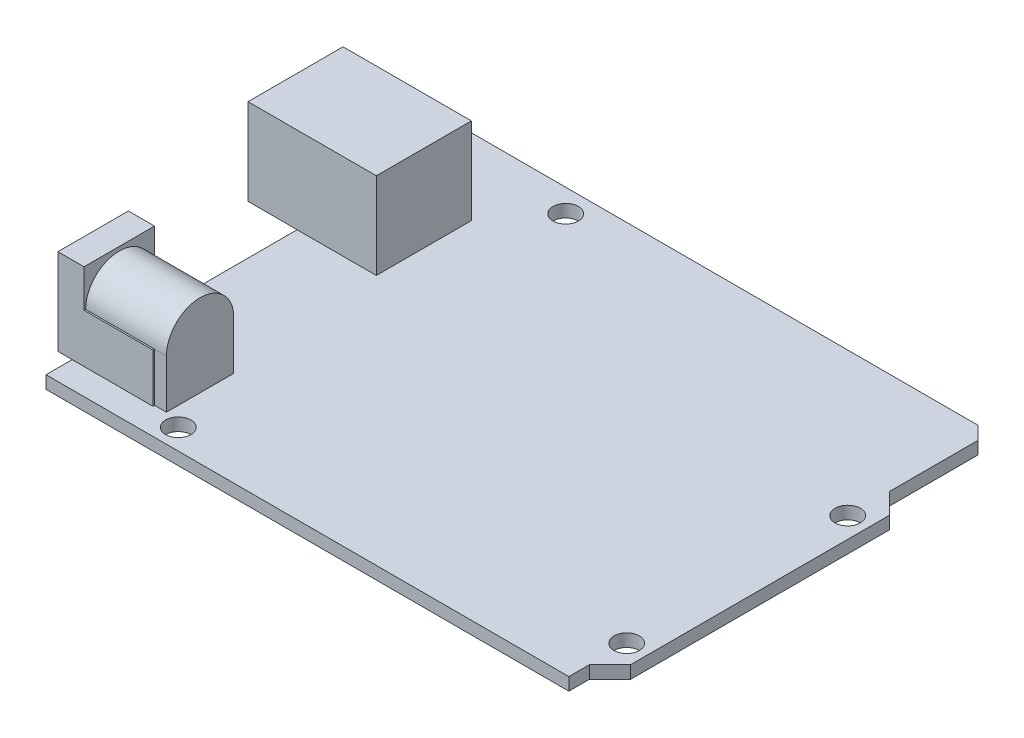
ISO-10303-21;
HEADER;
FILE_DESCRIPTION(('STEP AP214'),'2;1');
FILE_NAME('part.step','',(''),(''),'','','');
FILE_SCHEMA(('AUTOMOTIVE_DESIGN { 1 0 10303 214 1 1 1 1 }'));
ENDSEC;
DATA;
#1=APPLICATION_CONTEXT('core data for automotive mechanical design processes');
#2=APPLICATION_PROTOCOL_DEFINITION('international standard','automotive_design',2000,#1);
#3=PRODUCT_CONTEXT('',#1,'mechanical');
#4=PRODUCT('Part','Part','',(#3));
#5=PRODUCT_RELATED_PRODUCT_CATEGORY('part','',(#4));
#6=PRODUCT_DEFINITION_FORMATION('','',#4);
#7=PRODUCT_DEFINITION_CONTEXT('part definition',#1,'design');
#8=PRODUCT_DEFINITION('design','',#6,#7);
#9=PRODUCT_DEFINITION_SHAPE('','',#8);
#10=(LENGTH_UNIT() NAMED_UNIT(*) SI_UNIT(.MILLI.,.METRE.));
#11=(NAMED_UNIT(*) PLANE_ANGLE_UNIT() SI_UNIT($,.RADIAN.));
#12=(NAMED_UNIT(*) SI_UNIT($,.STERADIAN.) SOLID_ANGLE_UNIT());
#13=UNCERTAINTY_MEASURE_WITH_UNIT(LENGTH_MEASURE(1.E-05),#10,'distance_accuracy_value','');
#14=(GEOMETRIC_REPRESENTATION_CONTEXT(3) GLOBAL_UNCERTAINTY_ASSIGNED_CONTEXT((#13)) GLOBAL_UNIT_ASSIGNED_CONTEXT((#10,
#11,#12)) REPRESENTATION_CONTEXT('',''));
#15=CARTESIAN_POINT('',(0.,0.,0.));
#16=DIRECTION('',(0.,0.,1.));
#17=DIRECTION('',(1.,0.,0.));
#18=AXIS2_PLACEMENT_3D('',#15,#16,#17);
#19=CARTESIAN_POINT('',(0.,12.5,0.));
#20=DIRECTION('',(0.,1.,0.));
#21=DIRECTION('',(0.,0.,1.));
#22=AXIS2_PLACEMENT_3D('',#19,#20,#21);
#23=PLANE('',#22);
#24=DIRECTION('',(1.,0.,0.));
#25=VECTOR('',#24,1.);
#26=CARTESIAN_POINT('',(-36.1,12.5,23.35));
#27=LINE('',#26,#25);
#28=CARTESIAN_POINT('',(-36.1,12.5,23.35));
#29=VERTEX_POINT('',#28);
#30=CARTESIAN_POINT('',(-32.8,12.5,23.35));
#31=VERTEX_POINT('',#30);
#32=EDGE_CURVE('E281',#29,#31,#27,.T.);
#33=ORIENTED_EDGE('',*,*,#32,.T.);
#34=DIRECTION('',(0.,0.,-1.));
#35=VECTOR('',#34,1.);
#36=CARTESIAN_POINT('',(-32.8,12.5,0.));
#37=LINE('',#36,#35);
#38=CARTESIAN_POINT('',(-32.8,12.5,14.45));
#39=VERTEX_POINT('',#38);
#40=EDGE_CURVE('E11',#31,#39,#37,.T.);
#41=ORIENTED_EDGE('',*,*,#40,.T.);
#42=DIRECTION('',(-1.,0.,0.));
#43=VECTOR('',#42,1.);
#44=CARTESIAN_POINT('',(-36.1,12.5,14.45));
#45=LINE('',#44,#43);
#46=CARTESIAN_POINT('',(-36.1,12.5,14.45));
#47=VERTEX_POINT('',#46);
#48=EDGE_CURVE('E284',#39,#47,#45,.T.);
#49=ORIENTED_EDGE('',*,*,#48,.T.);
#50=DIRECTION('',(0.,0.,1.));
#51=VECTOR('',#50,1.);
#52=CARTESIAN_POINT('',(-36.1,12.5,14.45));
#53=LINE('',#52,#51);
#54=EDGE_CURVE('E278',#47,#29,#53,.T.);
#55=ORIENTED_EDGE('',*,*,#54,.T.);
#56=EDGE_LOOP('',(#33,#41,#49,#55));
#57=FACE_BOUND('',#56,.T.);
#58=ADVANCED_FACE('F32',(#57),#23,.T.);
#59=CARTESIAN_POINT('',(-22.6,12.5,14.45));
#60=DIRECTION('',(-1.,0.,0.));
#61=DIRECTION('',(0.,0.,1.));
#62=AXIS2_PLACEMENT_3D('',#59,#60,#61);
#63=PLANE('',#62);
#64=DIRECTION('',(0.,-1.,0.));
#65=VECTOR('',#64,1.);
#66=CARTESIAN_POINT('',(-22.6,0.,14.65));
#67=LINE('',#66,#65);
#68=CARTESIAN_POINT('',(-22.6,7.75,14.65));
#69=VERTEX_POINT('',#68);
#70=CARTESIAN_POINT('',(-22.6,1.6,14.65));
#71=VERTEX_POINT('',#70);
#72=EDGE_CURVE('E247',#69,#71,#67,.T.);
#73=ORIENTED_EDGE('',*,*,#72,.F.);
#74=CARTESIAN_POINT('',(-22.6,7.75,18.9));
#75=DIRECTION('',(-1.,0.,0.));
#76=DIRECTION('',(0.,0.,-1.));
#77=AXIS2_PLACEMENT_3D('',#74,#75,#76);
#78=CIRCLE('',#77,4.25);
#79=CARTESIAN_POINT('',(-22.6,7.75,23.15));
#80=VERTEX_POINT('',#79);
#81=EDGE_CURVE('E217',#80,#69,#78,.T.);
#82=ORIENTED_EDGE('',*,*,#81,.F.);
#83=DIRECTION('',(0.,-1.,0.));
#84=VECTOR('',#83,1.);
#85=CARTESIAN_POINT('',(-22.6,0.,23.15));
#86=LINE('',#85,#84);
#87=CARTESIAN_POINT('',(-22.6,1.6,23.15));
#88=VERTEX_POINT('',#87);
#89=EDGE_CURVE('E260',#80,#88,#86,.T.);
#90=ORIENTED_EDGE('',*,*,#89,.T.);
#91=DIRECTION('',(0.,0.,-1.));
#92=VECTOR('',#91,1.);
#93=CARTESIAN_POINT('',(-22.6,1.6,14.45));
#94=LINE('',#93,#92);
#95=EDGE_CURVE('E293',#88,#71,#94,.T.);
#96=ORIENTED_EDGE('',*,*,#95,.T.);
#97=EDGE_LOOP('',(#73,#82,#90,#96));
#98=FACE_BOUND('',#97,.T.);
#99=ADVANCED_FACE('F519',(#98),#63,.F.);
#100=CARTESIAN_POINT('',(-36.1,12.5,14.45));
#101=DIRECTION('',(0.,0.,1.));
#102=DIRECTION('',(1.,0.,0.));
#103=AXIS2_PLACEMENT_3D('',#100,#101,#102);
#104=PLANE('',#103);
#105=DIRECTION('',(0.,1.,0.));
#106=VECTOR('',#105,1.);
#107=CARTESIAN_POINT('',(-32.8,12.5,14.45));
#108=LINE('',#107,#106);
#109=CARTESIAN_POINT('',(-32.8,7.75,14.45));
#110=VERTEX_POINT('',#109);
#111=EDGE_CURVE('E245',#110,#39,#108,.T.);
#112=ORIENTED_EDGE('',*,*,#111,.F.);
#113=DIRECTION('',(1.,0.,0.));
#114=VECTOR('',#113,1.);
#115=CARTESIAN_POINT('',(-36.1,7.75,14.45));
#116=LINE('',#115,#114);
#117=CARTESIAN_POINT('',(-24.1,7.75,14.45));
#118=VERTEX_POINT('',#117);
#119=EDGE_CURVE('E238',#110,#118,#116,.T.);
#120=ORIENTED_EDGE('',*,*,#119,.T.);
#121=DIRECTION('',(0.,1.,0.));
#122=VECTOR('',#121,1.);
#123=CARTESIAN_POINT('',(-24.1,0.,14.45));
#124=LINE('',#123,#122);
#125=CARTESIAN_POINT('',(-24.1,1.6,14.45));
#126=VERTEX_POINT('',#125);
#127=EDGE_CURVE('E253',#126,#118,#124,.T.);
#128=ORIENTED_EDGE('',*,*,#127,.F.);
#129=DIRECTION('',(-1.,0.,0.));
#130=VECTOR('',#129,1.);
#131=CARTESIAN_POINT('',(-36.1,1.6,14.45));
#132=LINE('',#131,#130);
#133=CARTESIAN_POINT('',(-34.3,1.6,14.45));
#134=VERTEX_POINT('',#133);
#135=EDGE_CURVE('E54',#126,#134,#132,.T.);
#136=ORIENTED_EDGE('',*,*,#135,.T.);
#137=CARTESIAN_POINT('',(-36.1,1.6,14.45));
#138=VERTEX_POINT('',#137);
#139=EDGE_CURVE('E296',#134,#138,#132,.T.);
#140=ORIENTED_EDGE('',*,*,#139,.T.);
#141=DIRECTION('',(0.,-1.,0.));
#142=VECTOR('',#141,1.);
#143=CARTESIAN_POINT('',(-36.1,12.5,14.45));
#144=LINE('',#143,#142);
#145=EDGE_CURVE('E286',#47,#138,#144,.T.);
#146=ORIENTED_EDGE('',*,*,#145,.F.);
#147=ORIENTED_EDGE('',*,*,#48,.F.);
#148=EDGE_LOOP('',(#112,#120,#128,#136,#140,#146,#147));
#149=FACE_BOUND('',#148,.T.);
#150=ADVANCED_FACE('F525',(#149),#104,.F.);
#151=CARTESIAN_POINT('',(0.,1.6,0.));
#152=DIRECTION('',(0.,1.,0.));
#153=DIRECTION('',(0.,0.,1.));
#154=AXIS2_PLACEMENT_3D('',#151,#152,#153);
#155=PLANE('',#154);
#156=CARTESIAN_POINT('',(31.7,1.6,-8.54999999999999));
#157=DIRECTION('',(0.,1.,0.));
#158=DIRECTION('',(0.,0.,1.));
#159=AXIS2_PLACEMENT_3D('',#156,#157,#158);
#160=CIRCLE('',#159,1.6);
#161=CARTESIAN_POINT('',(31.7,1.6,-6.94999999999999));
#162=VERTEX_POINT('',#161);
#163=EDGE_CURVE('E344',#162,#162,#160,.T.);
#164=ORIENTED_EDGE('',*,*,#163,.F.);
#165=EDGE_LOOP('',(#164));
#166=FACE_BOUND('',#165,.T.);
#167=CARTESIAN_POINT('',(-19.1,1.6,-23.75));
#168=DIRECTION('',(0.,1.,0.));
#169=DIRECTION('',(0.,0.,1.));
#170=AXIS2_PLACEMENT_3D('',#167,#168,#169);
#171=CIRCLE('',#170,1.6);
#172=CARTESIAN_POINT('',(-19.1,1.6,-22.15));
#173=VERTEX_POINT('',#172);
#174=EDGE_CURVE('E356',#173,#173,#171,.T.);
#175=ORIENTED_EDGE('',*,*,#174,.F.);
#176=EDGE_LOOP('',(#175));
#177=FACE_BOUND('',#176,.T.);
#178=CARTESIAN_POINT('',(-20.2,1.6,24.05));
#179=DIRECTION('',(0.,1.,0.));
#180=DIRECTION('',(0.,0.,1.));
#181=AXIS2_PLACEMENT_3D('',#178,#179,#180);
#182=CIRCLE('',#181,1.6);
#183=CARTESIAN_POINT('',(-20.2,1.6,25.65));
#184=VERTEX_POINT('',#183);
#185=EDGE_CURVE('E350',#184,#184,#182,.T.);
#186=ORIENTED_EDGE('',*,*,#185,.F.);
#187=EDGE_LOOP('',(#186));
#188=FACE_BOUND('',#187,.T.);
#189=CARTESIAN_POINT('',(31.7,1.6,19.35));
#190=DIRECTION('',(0.,1.,0.));
#191=DIRECTION('',(0.,0.,1.));
#192=AXIS2_PLACEMENT_3D('',#189,#190,#191);
#193=CIRCLE('',#192,1.6);
#194=CARTESIAN_POINT('',(31.7,1.6,20.95));
#195=VERTEX_POINT('',#194);
#196=EDGE_CURVE('E338',#195,#195,#193,.T.);
#197=ORIENTED_EDGE('',*,*,#196,.F.);
#198=EDGE_LOOP('',(#197));
#199=FACE_BOUND('',#198,.T.);
#200=ORIENTED_EDGE('',*,*,#95,.F.);
#201=DIRECTION('',(1.,0.,0.));
#202=VECTOR('',#201,1.);
#203=CARTESIAN_POINT('',(-24.1,1.6,23.15));
#204=LINE('',#203,#202);
#205=CARTESIAN_POINT('',(-24.1,1.6,23.15));
#206=VERTEX_POINT('',#205);
#207=EDGE_CURVE('E274',#206,#88,#204,.T.);
#208=ORIENTED_EDGE('',*,*,#207,.F.);
#209=DIRECTION('',(0.,0.,-1.));
#210=VECTOR('',#209,1.);
#211=CARTESIAN_POINT('',(-24.1,1.6,0.));
#212=LINE('',#211,#210);
#213=CARTESIAN_POINT('',(-24.1,1.6,23.35));
#214=VERTEX_POINT('',#213);
#215=EDGE_CURVE('E268',#214,#206,#212,.T.);
#216=ORIENTED_EDGE('',*,*,#215,.F.);
#217=DIRECTION('',(1.,0.,0.));
#218=VECTOR('',#217,1.);
#219=CARTESIAN_POINT('',(-36.1,1.6,23.35));
#220=LINE('',#219,#218);
#221=CARTESIAN_POINT('',(-34.3,1.6,23.35));
#222=VERTEX_POINT('',#221);
#223=EDGE_CURVE('E289',#222,#214,#220,.T.);
#224=ORIENTED_EDGE('',*,*,#223,.F.);
#225=DIRECTION('',(0.,0.,1.));
#226=VECTOR('',#225,1.);
#227=CARTESIAN_POINT('',(-34.3,1.6,-26.65));
#228=LINE('',#227,#226);
#229=CARTESIAN_POINT('',(-34.3,1.6,26.65));
#230=VERTEX_POINT('',#229);
#231=EDGE_CURVE('E367',#222,#230,#228,.T.);
#232=ORIENTED_EDGE('',*,*,#231,.T.);
#233=DIRECTION('',(1.,0.,0.));
#234=VECTOR('',#233,1.);
#235=CARTESIAN_POINT('',(-34.3,1.6,26.65));
#236=LINE('',#235,#234);
#237=CARTESIAN_POINT('',(31.7,1.6,26.65));
#238=VERTEX_POINT('',#237);
#239=EDGE_CURVE('E365',#230,#238,#236,.T.);
#240=ORIENTED_EDGE('',*,*,#239,.T.);
#241=DIRECTION('',(0.,0.,-1.));
#242=VECTOR('',#241,1.);
#243=CARTESIAN_POINT('',(31.7,1.6,24.05));
#244=LINE('',#243,#242);
#245=CARTESIAN_POINT('',(31.7,1.6,24.05));
#246=VERTEX_POINT('',#245);
#247=EDGE_CURVE('E369',#238,#246,#244,.T.);
#248=ORIENTED_EDGE('',*,*,#247,.T.);
#249=DIRECTION('',(0.707106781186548,0.,-0.707106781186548));
#250=VECTOR('',#249,1.);
#251=CARTESIAN_POINT('',(34.3,1.6,21.45));
#252=LINE('',#251,#250);
#253=CARTESIAN_POINT('',(34.3,1.6,21.45));
#254=VERTEX_POINT('',#253);
#255=EDGE_CURVE('E371',#246,#254,#252,.T.);
#256=ORIENTED_EDGE('',*,*,#255,.T.);
#257=DIRECTION('',(0.,0.,-1.));
#258=VECTOR('',#257,1.);
#259=CARTESIAN_POINT('',(34.3,1.6,-11.25));
#260=LINE('',#259,#258);
#261=CARTESIAN_POINT('',(34.3,1.6,-11.25));
#262=VERTEX_POINT('',#261);
#263=EDGE_CURVE('E373',#254,#262,#260,.T.);
#264=ORIENTED_EDGE('',*,*,#263,.T.);
#265=DIRECTION('',(-0.707106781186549,0.,-0.707106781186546));
#266=VECTOR('',#265,1.);
#267=CARTESIAN_POINT('',(31.7,1.6,-13.85));
#268=LINE('',#267,#266);
#269=CARTESIAN_POINT('',(31.7,1.6,-13.85));
#270=VERTEX_POINT('',#269);
#271=EDGE_CURVE('E375',#262,#270,#268,.T.);
#272=ORIENTED_EDGE('',*,*,#271,.T.);
#273=DIRECTION('',(0.,0.,-1.));
#274=VECTOR('',#273,1.);
#275=CARTESIAN_POINT('',(31.7,1.6,-25.));
#276=LINE('',#275,#274);
#277=CARTESIAN_POINT('',(31.7,1.6,-25.));
#278=VERTEX_POINT('',#277);
#279=EDGE_CURVE('E377',#270,#278,#276,.T.);
#280=ORIENTED_EDGE('',*,*,#279,.T.);
#281=DIRECTION('',(-0.707106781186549,0.,-0.707106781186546));
#282=VECTOR('',#281,1.);
#283=CARTESIAN_POINT('',(30.05,1.6,-26.65));
#284=LINE('',#283,#282);
#285=CARTESIAN_POINT('',(30.05,1.6,-26.65));
#286=VERTEX_POINT('',#285);
#287=EDGE_CURVE('E379',#278,#286,#284,.T.);
#288=ORIENTED_EDGE('',*,*,#287,.T.);
#289=DIRECTION('',(-1.,0.,0.));
#290=VECTOR('',#289,1.);
#291=CARTESIAN_POINT('',(-34.3,1.6,-26.65));
#292=LINE('',#291,#290);
#293=CARTESIAN_POINT('',(-34.3,1.6,-26.65));
#294=VERTEX_POINT('',#293);
#295=EDGE_CURVE('E381',#286,#294,#292,.T.);
#296=ORIENTED_EDGE('',*,*,#295,.T.);
#297=CARTESIAN_POINT('',(-34.3,1.6,-17.05));
#298=VERTEX_POINT('',#297);
#299=EDGE_CURVE('E362',#294,#298,#228,.T.);
#300=ORIENTED_EDGE('',*,*,#299,.T.);
#301=DIRECTION('',(-1.,0.,0.));
#302=VECTOR('',#301,1.);
#303=CARTESIAN_POINT('',(-40.5,1.6,-17.05));
#304=LINE('',#303,#302);
#305=CARTESIAN_POINT('',(-24.3,1.6,-17.05));
#306=VERTEX_POINT('',#305);
#307=EDGE_CURVE('E308',#306,#298,#304,.T.);
#308=ORIENTED_EDGE('',*,*,#307,.F.);
#309=DIRECTION('',(0.,0.,-1.));
#310=VECTOR('',#309,1.);
#311=CARTESIAN_POINT('',(-24.3,1.6,-17.05));
#312=LINE('',#311,#310);
#313=CARTESIAN_POINT('',(-24.3,1.6,-5.05));
#314=VERTEX_POINT('',#313);
#315=EDGE_CURVE('E320',#314,#306,#312,.T.);
#316=ORIENTED_EDGE('',*,*,#315,.F.);
#317=DIRECTION('',(1.,0.,0.));
#318=VECTOR('',#317,1.);
#319=CARTESIAN_POINT('',(-40.5,1.6,-5.05));
#320=LINE('',#319,#318);
#321=CARTESIAN_POINT('',(-34.3,1.6,-5.05));
#322=VERTEX_POINT('',#321);
#323=EDGE_CURVE('E40',#322,#314,#320,.T.);
#324=ORIENTED_EDGE('',*,*,#323,.F.);
#325=EDGE_CURVE('E455',#322,#134,#228,.T.);
#326=ORIENTED_EDGE('',*,*,#325,.T.);
#327=ORIENTED_EDGE('',*,*,#135,.F.);
#328=DIRECTION('',(0.,0.,-1.));
#329=VECTOR('',#328,1.);
#330=CARTESIAN_POINT('',(-24.1,1.6,0.));
#331=LINE('',#330,#329);
#332=CARTESIAN_POINT('',(-24.1,1.6,14.65));
#333=VERTEX_POINT('',#332);
#334=EDGE_CURVE('E47',#333,#126,#331,.T.);
#335=ORIENTED_EDGE('',*,*,#334,.F.);
#336=DIRECTION('',(1.,0.,0.));
#337=VECTOR('',#336,1.);
#338=CARTESIAN_POINT('',(-24.1,1.6,14.65));
#339=LINE('',#338,#337);
#340=EDGE_CURVE('E258',#333,#71,#339,.T.);
#341=ORIENTED_EDGE('',*,*,#340,.T.);
#342=EDGE_LOOP('',(#200,#208,#216,#224,#232,#240,#248,#256,#264,#272,#280,#288,#296,#300,#308,
#316,#324,#326,#327,#335,#341));
#343=FACE_BOUND('',#342,.T.);
#344=ADVANCED_FACE('F462',(#166,#177,#188,#199,#343),#155,.T.);
#345=CARTESIAN_POINT('',(0.,0.,0.));
#346=DIRECTION('',(0.,1.,0.));
#347=DIRECTION('',(0.,0.,1.));
#348=AXIS2_PLACEMENT_3D('',#345,#346,#347);
#349=PLANE('',#348);
#350=DIRECTION('',(0.,0.,1.));
#351=VECTOR('',#350,1.);
#352=CARTESIAN_POINT('',(-34.3,0.,-26.65));
#353=LINE('',#352,#351);
#354=CARTESIAN_POINT('',(-34.3,0.,-26.65));
#355=VERTEX_POINT('',#354);
#356=CARTESIAN_POINT('',(-34.3,0.,26.65));
#357=VERTEX_POINT('',#356);
#358=EDGE_CURVE('E359',#355,#357,#353,.T.);
#359=ORIENTED_EDGE('',*,*,#358,.F.);
#360=DIRECTION('',(-1.,0.,0.));
#361=VECTOR('',#360,1.);
#362=CARTESIAN_POINT('',(-34.3,0.,-26.65));
#363=LINE('',#362,#361);
#364=CARTESIAN_POINT('',(30.05,0.,-26.65));
#365=VERTEX_POINT('',#364);
#366=EDGE_CURVE('E400',#365,#355,#363,.T.);
#367=ORIENTED_EDGE('',*,*,#366,.F.);
#368=DIRECTION('',(-0.707106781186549,0.,-0.707106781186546));
#369=VECTOR('',#368,1.);
#370=CARTESIAN_POINT('',(30.05,0.,-26.65));
#371=LINE('',#370,#369);
#372=CARTESIAN_POINT('',(31.7,0.,-25.));
#373=VERTEX_POINT('',#372);
#374=EDGE_CURVE('E398',#373,#365,#371,.T.);
#375=ORIENTED_EDGE('',*,*,#374,.F.);
#376=DIRECTION('',(0.,0.,-1.));
#377=VECTOR('',#376,1.);
#378=CARTESIAN_POINT('',(31.7,0.,-25.));
#379=LINE('',#378,#377);
#380=CARTESIAN_POINT('',(31.7,0.,-13.85));
#381=VERTEX_POINT('',#380);
#382=EDGE_CURVE('E396',#381,#373,#379,.T.);
#383=ORIENTED_EDGE('',*,*,#382,.F.);
#384=DIRECTION('',(-0.707106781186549,0.,-0.707106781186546));
#385=VECTOR('',#384,1.);
#386=CARTESIAN_POINT('',(31.7,0.,-13.85));
#387=LINE('',#386,#385);
#388=CARTESIAN_POINT('',(34.3,0.,-11.25));
#389=VERTEX_POINT('',#388);
#390=EDGE_CURVE('E394',#389,#381,#387,.T.);
#391=ORIENTED_EDGE('',*,*,#390,.F.);
#392=DIRECTION('',(0.,0.,-1.));
#393=VECTOR('',#392,1.);
#394=CARTESIAN_POINT('',(34.3,0.,-11.25));
#395=LINE('',#394,#393);
#396=CARTESIAN_POINT('',(34.3,0.,21.45));
#397=VERTEX_POINT('',#396);
#398=EDGE_CURVE('E392',#397,#389,#395,.T.);
#399=ORIENTED_EDGE('',*,*,#398,.F.);
#400=DIRECTION('',(0.707106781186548,0.,-0.707106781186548));
#401=VECTOR('',#400,1.);
#402=CARTESIAN_POINT('',(34.3,0.,21.45));
#403=LINE('',#402,#401);
#404=CARTESIAN_POINT('',(31.7,0.,24.05));
#405=VERTEX_POINT('',#404);
#406=EDGE_CURVE('E390',#405,#397,#403,.T.);
#407=ORIENTED_EDGE('',*,*,#406,.F.);
#408=DIRECTION('',(0.,0.,-1.));
#409=VECTOR('',#408,1.);
#410=CARTESIAN_POINT('',(31.7,0.,24.05));
#411=LINE('',#410,#409);
#412=CARTESIAN_POINT('',(31.7,0.,26.65));
#413=VERTEX_POINT('',#412);
#414=EDGE_CURVE('E388',#413,#405,#411,.T.);
#415=ORIENTED_EDGE('',*,*,#414,.F.);
#416=DIRECTION('',(1.,0.,0.));
#417=VECTOR('',#416,1.);
#418=CARTESIAN_POINT('',(-34.3,0.,26.65));
#419=LINE('',#418,#417);
#420=EDGE_CURVE('E386',#357,#413,#419,.T.);
#421=ORIENTED_EDGE('',*,*,#420,.F.);
#422=EDGE_LOOP('',(#359,#367,#375,#383,#391,#399,#407,#415,#421));
#423=FACE_BOUND('',#422,.T.);
#424=CARTESIAN_POINT('',(-19.1,0.,-23.75));
#425=DIRECTION('',(0.,1.,0.));
#426=DIRECTION('',(0.,0.,1.));
#427=AXIS2_PLACEMENT_3D('',#424,#425,#426);
#428=CIRCLE('',#427,1.6);
#429=CARTESIAN_POINT('',(-19.1,0.,-22.15));
#430=VERTEX_POINT('',#429);
#431=EDGE_CURVE('E353',#430,#430,#428,.T.);
#432=ORIENTED_EDGE('',*,*,#431,.T.);
#433=EDGE_LOOP('',(#432));
#434=FACE_BOUND('',#433,.T.);
#435=CARTESIAN_POINT('',(-20.2,0.,24.05));
#436=DIRECTION('',(0.,1.,0.));
#437=DIRECTION('',(0.,0.,1.));
#438=AXIS2_PLACEMENT_3D('',#435,#436,#437);
#439=CIRCLE('',#438,1.6);
#440=CARTESIAN_POINT('',(-20.2,0.,25.65));
#441=VERTEX_POINT('',#440);
#442=EDGE_CURVE('E347',#441,#441,#439,.T.);
#443=ORIENTED_EDGE('',*,*,#442,.T.);
#444=EDGE_LOOP('',(#443));
#445=FACE_BOUND('',#444,.T.);
#446=CARTESIAN_POINT('',(31.7,0.,-8.54999999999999));
#447=DIRECTION('',(0.,1.,0.));
#448=DIRECTION('',(0.,0.,1.));
#449=AXIS2_PLACEMENT_3D('',#446,#447,#448);
#450=CIRCLE('',#449,1.6);
#451=CARTESIAN_POINT('',(31.7,0.,-6.94999999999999));
#452=VERTEX_POINT('',#451);
#453=EDGE_CURVE('E341',#452,#452,#450,.T.);
#454=ORIENTED_EDGE('',*,*,#453,.T.);
#455=EDGE_LOOP('',(#454));
#456=FACE_BOUND('',#455,.T.);
#457=CARTESIAN_POINT('',(31.7,0.,19.35));
#458=DIRECTION('',(0.,1.,0.));
#459=DIRECTION('',(0.,0.,1.));
#460=AXIS2_PLACEMENT_3D('',#457,#458,#459);
#461=CIRCLE('',#460,1.6);
#462=CARTESIAN_POINT('',(31.7,0.,20.95));
#463=VERTEX_POINT('',#462);
#464=EDGE_CURVE('E337',#463,#463,#461,.T.);
#465=ORIENTED_EDGE('',*,*,#464,.T.);
#466=EDGE_LOOP('',(#465));
#467=FACE_BOUND('',#466,.T.);
#468=ADVANCED_FACE('F472',(#423,#434,#445,#456,#467),#349,.F.);
#469=CARTESIAN_POINT('',(-34.3,1.6,-26.65));
#470=DIRECTION('',(1.,0.,0.));
#471=DIRECTION('',(0.,0.,-1.));
#472=AXIS2_PLACEMENT_3D('',#469,#470,#471);
#473=PLANE('',#472);
#474=ORIENTED_EDGE('',*,*,#358,.T.);
#475=DIRECTION('',(0.,-1.,0.));
#476=VECTOR('',#475,1.);
#477=CARTESIAN_POINT('',(-34.3,1.6,26.65));
#478=LINE('',#477,#476);
#479=EDGE_CURVE('E424',#230,#357,#478,.T.);
#480=ORIENTED_EDGE('',*,*,#479,.F.);
#481=ORIENTED_EDGE('',*,*,#231,.F.);
#482=EDGE_CURVE('E456',#134,#222,#228,.T.);
#483=ORIENTED_EDGE('',*,*,#482,.F.);
#484=ORIENTED_EDGE('',*,*,#325,.F.);
#485=EDGE_CURVE('E366',#298,#322,#228,.T.);
#486=ORIENTED_EDGE('',*,*,#485,.F.);
#487=ORIENTED_EDGE('',*,*,#299,.F.);
#488=DIRECTION('',(0.,-1.,0.));
#489=VECTOR('',#488,1.);
#490=CARTESIAN_POINT('',(-34.3,1.6,-26.65));
#491=LINE('',#490,#489);
#492=EDGE_CURVE('E383',#294,#355,#491,.T.);
#493=ORIENTED_EDGE('',*,*,#492,.T.);
#494=EDGE_LOOP('',(#474,#480,#481,#483,#484,#486,#487,#493));
#495=FACE_BOUND('',#494,.T.);
#496=ADVANCED_FACE('F34',(#495),#473,.F.);
#497=CARTESIAN_POINT('',(-34.3,1.6,26.65));
#498=DIRECTION('',(0.,0.,-1.));
#499=DIRECTION('',(-1.,0.,0.));
#500=AXIS2_PLACEMENT_3D('',#497,#498,#499);
#501=PLANE('',#500);
#502=ORIENTED_EDGE('',*,*,#420,.T.);
#503=DIRECTION('',(0.,-1.,0.));
#504=VECTOR('',#503,1.);
#505=CARTESIAN_POINT('',(31.7,1.6,26.65));
#506=LINE('',#505,#504);
#507=EDGE_CURVE('E422',#238,#413,#506,.T.);
#508=ORIENTED_EDGE('',*,*,#507,.F.);
#509=ORIENTED_EDGE('',*,*,#239,.F.);
#510=ORIENTED_EDGE('',*,*,#479,.T.);
#511=EDGE_LOOP('',(#502,#508,#509,#510));
#512=FACE_BOUND('',#511,.T.);
#513=ADVANCED_FACE('F466',(#512),#501,.F.);
#514=CARTESIAN_POINT('',(31.7,1.6,24.05));
#515=DIRECTION('',(-1.,0.,0.));
#516=DIRECTION('',(0.,0.,1.));
#517=AXIS2_PLACEMENT_3D('',#514,#515,#516);
#518=PLANE('',#517);
#519=ORIENTED_EDGE('',*,*,#414,.T.);
#520=DIRECTION('',(0.,-1.,0.));
#521=VECTOR('',#520,1.);
#522=CARTESIAN_POINT('',(31.7,1.6,24.05));
#523=LINE('',#522,#521);
#524=EDGE_CURVE('E419',#246,#405,#523,.T.);
#525=ORIENTED_EDGE('',*,*,#524,.F.);
#526=ORIENTED_EDGE('',*,*,#247,.F.);
#527=ORIENTED_EDGE('',*,*,#507,.T.);
#528=EDGE_LOOP('',(#519,#525,#526,#527));
#529=FACE_BOUND('',#528,.T.);
#530=ADVANCED_FACE('F478',(#529),#518,.F.);
#531=CARTESIAN_POINT('',(34.3,1.6,21.45));
#532=DIRECTION('',(-0.707106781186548,0.,-0.707106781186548));
#533=DIRECTION('',(-0.707106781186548,0.,0.707106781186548));
#534=AXIS2_PLACEMENT_3D('',#531,#532,#533);
#535=PLANE('',#534);
#536=ORIENTED_EDGE('',*,*,#406,.T.);
#537=DIRECTION('',(0.,-1.,0.));
#538=VECTOR('',#537,1.);
#539=CARTESIAN_POINT('',(34.3,1.6,21.45));
#540=LINE('',#539,#538);
#541=EDGE_CURVE('E416',#254,#397,#540,.T.);
#542=ORIENTED_EDGE('',*,*,#541,.F.);
#543=ORIENTED_EDGE('',*,*,#255,.F.);
#544=ORIENTED_EDGE('',*,*,#524,.T.);
#545=EDGE_LOOP('',(#536,#542,#543,#544));
#546=FACE_BOUND('',#545,.T.);
#547=ADVANCED_FACE('F485',(#546),#535,.F.);
#548=CARTESIAN_POINT('',(34.3,1.6,-11.25));
#549=DIRECTION('',(-1.,0.,0.));
#550=DIRECTION('',(0.,0.,1.));
#551=AXIS2_PLACEMENT_3D('',#548,#549,#550);
#552=PLANE('',#551);
#553=ORIENTED_EDGE('',*,*,#398,.T.);
#554=DIRECTION('',(0.,-1.,0.));
#555=VECTOR('',#554,1.);
#556=CARTESIAN_POINT('',(34.3,1.6,-11.25));
#557=LINE('',#556,#555);
#558=EDGE_CURVE('E413',#262,#389,#557,.T.);
#559=ORIENTED_EDGE('',*,*,#558,.F.);
#560=ORIENTED_EDGE('',*,*,#263,.F.);
#561=ORIENTED_EDGE('',*,*,#541,.T.);
#562=EDGE_LOOP('',(#553,#559,#560,#561));
#563=FACE_BOUND('',#562,.T.);
#564=ADVANCED_FACE('F488',(#563),#552,.F.);
#565=CARTESIAN_POINT('',(31.7,1.6,-13.85));
#566=DIRECTION('',(-0.707106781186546,0.,0.707106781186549));
#567=DIRECTION('',(0.707106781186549,0.,0.707106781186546));
#568=AXIS2_PLACEMENT_3D('',#565,#566,#567);
#569=PLANE('',#568);
#570=ORIENTED_EDGE('',*,*,#390,.T.);
#571=DIRECTION('',(0.,-1.,0.));
#572=VECTOR('',#571,1.);
#573=CARTESIAN_POINT('',(31.7,1.6,-13.85));
#574=LINE('',#573,#572);
#575=EDGE_CURVE('E410',#270,#381,#574,.T.);
#576=ORIENTED_EDGE('',*,*,#575,.F.);
#577=ORIENTED_EDGE('',*,*,#271,.F.);
#578=ORIENTED_EDGE('',*,*,#558,.T.);
#579=EDGE_LOOP('',(#570,#576,#577,#578));
#580=FACE_BOUND('',#579,.T.);
#581=ADVANCED_FACE('F493',(#580),#569,.F.);
#582=CARTESIAN_POINT('',(31.7,1.6,-25.));
#583=DIRECTION('',(-1.,0.,0.));
#584=DIRECTION('',(0.,0.,1.));
#585=AXIS2_PLACEMENT_3D('',#582,#583,#584);
#586=PLANE('',#585);
#587=ORIENTED_EDGE('',*,*,#382,.T.);
#588=DIRECTION('',(0.,-1.,0.));
#589=VECTOR('',#588,1.);
#590=CARTESIAN_POINT('',(31.7,1.6,-25.));
#591=LINE('',#590,#589);
#592=EDGE_CURVE('E407',#278,#373,#591,.T.);
#593=ORIENTED_EDGE('',*,*,#592,.F.);
#594=ORIENTED_EDGE('',*,*,#279,.F.);
#595=ORIENTED_EDGE('',*,*,#575,.T.);
#596=EDGE_LOOP('',(#587,#593,#594,#595));
#597=FACE_BOUND('',#596,.T.);
#598=ADVANCED_FACE('F499',(#597),#586,.F.);
#599=CARTESIAN_POINT('',(30.05,1.6,-26.65));
#600=DIRECTION('',(-0.707106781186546,0.,0.707106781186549));
#601=DIRECTION('',(0.707106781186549,0.,0.707106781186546));
#602=AXIS2_PLACEMENT_3D('',#599,#600,#601);
#603=PLANE('',#602);
#604=ORIENTED_EDGE('',*,*,#374,.T.);
#605=DIRECTION('',(0.,-1.,0.));
#606=VECTOR('',#605,1.);
#607=CARTESIAN_POINT('',(30.05,1.6,-26.65));
#608=LINE('',#607,#606);
#609=EDGE_CURVE('E404',#286,#365,#608,.T.);
#610=ORIENTED_EDGE('',*,*,#609,.F.);
#611=ORIENTED_EDGE('',*,*,#287,.F.);
#612=ORIENTED_EDGE('',*,*,#592,.T.);
#613=EDGE_LOOP('',(#604,#610,#611,#612));
#614=FACE_BOUND('',#613,.T.);
#615=ADVANCED_FACE('F502',(#614),#603,.F.);
#616=CARTESIAN_POINT('',(-34.3,1.6,-26.65));
#617=DIRECTION('',(0.,0.,1.));
#618=DIRECTION('',(1.,0.,0.));
#619=AXIS2_PLACEMENT_3D('',#616,#617,#618);
#620=PLANE('',#619);
#621=ORIENTED_EDGE('',*,*,#366,.T.);
#622=ORIENTED_EDGE('',*,*,#492,.F.);
#623=ORIENTED_EDGE('',*,*,#295,.F.);
#624=ORIENTED_EDGE('',*,*,#609,.T.);
#625=EDGE_LOOP('',(#621,#622,#623,#624));
#626=FACE_BOUND('',#625,.T.);
#627=ADVANCED_FACE('F505',(#626),#620,.F.);
#628=CARTESIAN_POINT('',(-19.1,1.6,-23.75));
#629=DIRECTION('',(0.,-1.,0.));
#630=DIRECTION('',(0.,0.,-1.));
#631=AXIS2_PLACEMENT_3D('',#628,#629,#630);
#632=CYLINDRICAL_SURFACE('',#631,1.6);
#633=ORIENTED_EDGE('',*,*,#174,.T.);
#634=EDGE_LOOP('',(#633));
#635=FACE_BOUND('',#634,.T.);
#636=ORIENTED_EDGE('',*,*,#431,.F.);
#637=EDGE_LOOP('',(#636));
#638=FACE_BOUND('',#637,.T.);
#639=ADVANCED_FACE('F564',(#635,#638),#632,.F.);
#640=CARTESIAN_POINT('',(-20.2,1.6,24.05));
#641=DIRECTION('',(0.,-1.,0.));
#642=DIRECTION('',(0.,0.,-1.));
#643=AXIS2_PLACEMENT_3D('',#640,#641,#642);
#644=CYLINDRICAL_SURFACE('',#643,1.6);
#645=ORIENTED_EDGE('',*,*,#185,.T.);
#646=EDGE_LOOP('',(#645));
#647=FACE_BOUND('',#646,.T.);
#648=ORIENTED_EDGE('',*,*,#442,.F.);
#649=EDGE_LOOP('',(#648));
#650=FACE_BOUND('',#649,.T.);
#651=ADVANCED_FACE('F556',(#647,#650),#644,.F.);
#652=CARTESIAN_POINT('',(31.7,1.6,-8.54999999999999));
#653=DIRECTION('',(0.,-1.,0.));
#654=DIRECTION('',(0.,0.,-1.));
#655=AXIS2_PLACEMENT_3D('',#652,#653,#654);
#656=CYLINDRICAL_SURFACE('',#655,1.6);
#657=ORIENTED_EDGE('',*,*,#163,.T.);
#658=EDGE_LOOP('',(#657));
#659=FACE_BOUND('',#658,.T.);
#660=ORIENTED_EDGE('',*,*,#453,.F.);
#661=EDGE_LOOP('',(#660));
#662=FACE_BOUND('',#661,.T.);
#663=ADVANCED_FACE('F550',(#659,#662),#656,.F.);
#664=CARTESIAN_POINT('',(31.7,1.6,19.35));
#665=DIRECTION('',(0.,-1.,0.));
#666=DIRECTION('',(0.,0.,-1.));
#667=AXIS2_PLACEMENT_3D('',#664,#665,#666);
#668=CYLINDRICAL_SURFACE('',#667,1.6);
#669=ORIENTED_EDGE('',*,*,#196,.T.);
#670=EDGE_LOOP('',(#669));
#671=FACE_BOUND('',#670,.T.);
#672=ORIENTED_EDGE('',*,*,#464,.F.);
#673=EDGE_LOOP('',(#672));
#674=FACE_BOUND('',#673,.T.);
#675=ADVANCED_FACE('F544',(#671,#674),#668,.F.);
#676=CARTESIAN_POINT('',(0.,1.6,0.));
#677=DIRECTION('',(0.,1.,0.));
#678=DIRECTION('',(0.,0.,1.));
#679=AXIS2_PLACEMENT_3D('',#676,#677,#678);
#680=PLANE('',#679);
#681=CARTESIAN_POINT('',(-40.5,1.6,-17.05));
#682=VERTEX_POINT('',#681);
#683=EDGE_CURVE('E323',#298,#682,#304,.T.);
#684=ORIENTED_EDGE('',*,*,#683,.F.);
#685=ORIENTED_EDGE('',*,*,#485,.T.);
#686=CARTESIAN_POINT('',(-40.5,1.6,-5.05));
#687=VERTEX_POINT('',#686);
#688=EDGE_CURVE('E317',#687,#322,#320,.T.);
#689=ORIENTED_EDGE('',*,*,#688,.F.);
#690=DIRECTION('',(0.,0.,1.));
#691=VECTOR('',#690,1.);
#692=CARTESIAN_POINT('',(-40.5,1.6,-17.05));
#693=LINE('',#692,#691);
#694=EDGE_CURVE('E303',#682,#687,#693,.T.);
#695=ORIENTED_EDGE('',*,*,#694,.F.);
#696=EDGE_LOOP('',(#684,#685,#689,#695));
#697=FACE_BOUND('',#696,.T.);
#698=ADVANCED_FACE('F451',(#697),#680,.F.);
#699=CARTESIAN_POINT('',(-40.5,12.5,-17.05));
#700=DIRECTION('',(1.,0.,0.));
#701=DIRECTION('',(0.,0.,-1.));
#702=AXIS2_PLACEMENT_3D('',#699,#700,#701);
#703=PLANE('',#702);
#704=ORIENTED_EDGE('',*,*,#694,.T.);
#705=DIRECTION('',(0.,-1.,0.));
#706=VECTOR('',#705,1.);
#707=CARTESIAN_POINT('',(-40.5,12.5,-5.05));
#708=LINE('',#707,#706);
#709=CARTESIAN_POINT('',(-40.5,12.5,-5.05));
#710=VERTEX_POINT('',#709);
#711=EDGE_CURVE('E334',#710,#687,#708,.T.);
#712=ORIENTED_EDGE('',*,*,#711,.F.);
#713=DIRECTION('',(0.,0.,1.));
#714=VECTOR('',#713,1.);
#715=CARTESIAN_POINT('',(-40.5,12.5,-17.05));
#716=LINE('',#715,#714);
#717=CARTESIAN_POINT('',(-40.5,12.5,-17.05));
#718=VERTEX_POINT('',#717);
#719=EDGE_CURVE('E304',#718,#710,#716,.T.);
#720=ORIENTED_EDGE('',*,*,#719,.F.);
#721=DIRECTION('',(0.,-1.,0.));
#722=VECTOR('',#721,1.);
#723=CARTESIAN_POINT('',(-40.5,12.5,-17.05));
#724=LINE('',#723,#722);
#725=EDGE_CURVE('E314',#718,#682,#724,.T.);
#726=ORIENTED_EDGE('',*,*,#725,.T.);
#727=EDGE_LOOP('',(#704,#712,#720,#726));
#728=FACE_BOUND('',#727,.T.);
#729=ADVANCED_FACE('F448',(#728),#703,.F.);
#730=CARTESIAN_POINT('',(-40.5,12.5,-5.05));
#731=DIRECTION('',(0.,0.,-1.));
#732=DIRECTION('',(-1.,0.,0.));
#733=AXIS2_PLACEMENT_3D('',#730,#731,#732);
#734=PLANE('',#733);
#735=ORIENTED_EDGE('',*,*,#688,.T.);
#736=ORIENTED_EDGE('',*,*,#323,.T.);
#737=DIRECTION('',(0.,-1.,0.));
#738=VECTOR('',#737,1.);
#739=CARTESIAN_POINT('',(-24.3,12.5,-5.05));
#740=LINE('',#739,#738);
#741=CARTESIAN_POINT('',(-24.3,12.5,-5.05));
#742=VERTEX_POINT('',#741);
#743=EDGE_CURVE('E331',#742,#314,#740,.T.);
#744=ORIENTED_EDGE('',*,*,#743,.F.);
#745=DIRECTION('',(1.,0.,0.));
#746=VECTOR('',#745,1.);
#747=CARTESIAN_POINT('',(-40.5,12.5,-5.05));
#748=LINE('',#747,#746);
#749=EDGE_CURVE('E307',#710,#742,#748,.T.);
#750=ORIENTED_EDGE('',*,*,#749,.F.);
#751=ORIENTED_EDGE('',*,*,#711,.T.);
#752=EDGE_LOOP('',(#735,#736,#744,#750,#751));
#753=FACE_BOUND('',#752,.T.);
#754=ADVANCED_FACE('F432',(#753),#734,.F.);
#755=CARTESIAN_POINT('',(-24.3,12.5,-17.05));
#756=DIRECTION('',(-1.,0.,0.));
#757=DIRECTION('',(0.,0.,1.));
#758=AXIS2_PLACEMENT_3D('',#755,#756,#757);
#759=PLANE('',#758);
#760=ORIENTED_EDGE('',*,*,#315,.T.);
#761=DIRECTION('',(0.,-1.,0.));
#762=VECTOR('',#761,1.);
#763=CARTESIAN_POINT('',(-24.3,12.5,-17.05));
#764=LINE('',#763,#762);
#765=CARTESIAN_POINT('',(-24.3,12.5,-17.05));
#766=VERTEX_POINT('',#765);
#767=EDGE_CURVE('E328',#766,#306,#764,.T.);
#768=ORIENTED_EDGE('',*,*,#767,.F.);
#769=DIRECTION('',(0.,0.,-1.));
#770=VECTOR('',#769,1.);
#771=CARTESIAN_POINT('',(-24.3,12.5,-17.05));
#772=LINE('',#771,#770);
#773=EDGE_CURVE('E310',#742,#766,#772,.T.);
#774=ORIENTED_EDGE('',*,*,#773,.F.);
#775=ORIENTED_EDGE('',*,*,#743,.T.);
#776=EDGE_LOOP('',(#760,#768,#774,#775));
#777=FACE_BOUND('',#776,.T.);
#778=ADVANCED_FACE('F438',(#777),#759,.F.);
#779=CARTESIAN_POINT('',(-40.5,12.5,-17.05));
#780=DIRECTION('',(0.,0.,1.));
#781=DIRECTION('',(1.,0.,0.));
#782=AXIS2_PLACEMENT_3D('',#779,#780,#781);
#783=PLANE('',#782);
#784=ORIENTED_EDGE('',*,*,#307,.T.);
#785=ORIENTED_EDGE('',*,*,#683,.T.);
#786=ORIENTED_EDGE('',*,*,#725,.F.);
#787=DIRECTION('',(-1.,0.,0.));
#788=VECTOR('',#787,1.);
#789=CARTESIAN_POINT('',(-40.5,12.5,-17.05));
#790=LINE('',#789,#788);
#791=EDGE_CURVE('E312',#766,#718,#790,.T.);
#792=ORIENTED_EDGE('',*,*,#791,.F.);
#793=ORIENTED_EDGE('',*,*,#767,.T.);
#794=EDGE_LOOP('',(#784,#785,#786,#792,#793));
#795=FACE_BOUND('',#794,.T.);
#796=ADVANCED_FACE('F507',(#795),#783,.F.);
#797=CARTESIAN_POINT('',(0.,12.5,0.));
#798=DIRECTION('',(0.,1.,0.));
#799=DIRECTION('',(0.,0.,1.));
#800=AXIS2_PLACEMENT_3D('',#797,#798,#799);
#801=PLANE('',#800);
#802=ORIENTED_EDGE('',*,*,#719,.T.);
#803=ORIENTED_EDGE('',*,*,#749,.T.);
#804=ORIENTED_EDGE('',*,*,#773,.T.);
#805=ORIENTED_EDGE('',*,*,#791,.T.);
#806=EDGE_LOOP('',(#802,#803,#804,#805));
#807=FACE_BOUND('',#806,.T.);
#808=ADVANCED_FACE('F442',(#807),#801,.T.);
#809=CARTESIAN_POINT('',(0.,1.6,0.));
#810=DIRECTION('',(0.,1.,0.));
#811=DIRECTION('',(0.,0.,1.));
#812=AXIS2_PLACEMENT_3D('',#809,#810,#811);
#813=PLANE('',#812);
#814=ORIENTED_EDGE('',*,*,#139,.F.);
#815=ORIENTED_EDGE('',*,*,#482,.T.);
#816=CARTESIAN_POINT('',(-36.1,1.6,23.35));
#817=VERTEX_POINT('',#816);
#818=EDGE_CURVE('E290',#817,#222,#220,.T.);
#819=ORIENTED_EDGE('',*,*,#818,.F.);
#820=DIRECTION('',(0.,0.,1.));
#821=VECTOR('',#820,1.);
#822=CARTESIAN_POINT('',(-36.1,1.6,14.45));
#823=LINE('',#822,#821);
#824=EDGE_CURVE('E276',#138,#817,#823,.T.);
#825=ORIENTED_EDGE('',*,*,#824,.F.);
#826=EDGE_LOOP('',(#814,#815,#819,#825));
#827=FACE_BOUND('',#826,.T.);
#828=ADVANCED_FACE('F514',(#827),#813,.F.);
#829=CARTESIAN_POINT('',(-36.1,12.5,14.45));
#830=DIRECTION('',(1.,0.,0.));
#831=DIRECTION('',(0.,0.,-1.));
#832=AXIS2_PLACEMENT_3D('',#829,#830,#831);
#833=PLANE('',#832);
#834=CARTESIAN_POINT('',(-36.1,7.75,18.9));
#835=DIRECTION('',(-1.,0.,0.));
#836=DIRECTION('',(0.,0.,1.));
#837=AXIS2_PLACEMENT_3D('',#834,#835,#836);
#838=CIRCLE('',#837,3.1);
#839=CARTESIAN_POINT('',(-36.1,7.75,22.));
#840=VERTEX_POINT('',#839);
#841=EDGE_CURVE('E863',#840,#840,#838,.T.);
#842=ORIENTED_EDGE('',*,*,#841,.F.);
#843=EDGE_LOOP('',(#842));
#844=FACE_BOUND('',#843,.T.);
#845=ORIENTED_EDGE('',*,*,#824,.T.);
#846=DIRECTION('',(0.,-1.,0.));
#847=VECTOR('',#846,1.);
#848=CARTESIAN_POINT('',(-36.1,12.5,23.35));
#849=LINE('',#848,#847);
#850=EDGE_CURVE('E300',#29,#817,#849,.T.);
#851=ORIENTED_EDGE('',*,*,#850,.F.);
#852=ORIENTED_EDGE('',*,*,#54,.F.);
#853=ORIENTED_EDGE('',*,*,#145,.T.);
#854=EDGE_LOOP('',(#845,#851,#852,#853));
#855=FACE_BOUND('',#854,.T.);
#856=ADVANCED_FACE('F534',(#844,#855),#833,.F.);
#857=CARTESIAN_POINT('',(-36.1,12.5,23.35));
#858=DIRECTION('',(0.,0.,-1.));
#859=DIRECTION('',(-1.,0.,0.));
#860=AXIS2_PLACEMENT_3D('',#857,#858,#859);
#861=PLANE('',#860);
#862=DIRECTION('',(0.,-1.,0.));
#863=VECTOR('',#862,1.);
#864=CARTESIAN_POINT('',(-24.1,0.,23.35));
#865=LINE('',#864,#863);
#866=CARTESIAN_POINT('',(-24.1,7.75,23.35));
#867=VERTEX_POINT('',#866);
#868=EDGE_CURVE('E266',#867,#214,#865,.T.);
#869=ORIENTED_EDGE('',*,*,#868,.F.);
#870=DIRECTION('',(-1.,0.,0.));
#871=VECTOR('',#870,1.);
#872=CARTESIAN_POINT('',(-36.1,7.75,23.35));
#873=LINE('',#872,#871);
#874=CARTESIAN_POINT('',(-32.8,7.75,23.35));
#875=VERTEX_POINT('',#874);
#876=EDGE_CURVE('E242',#867,#875,#873,.T.);
#877=ORIENTED_EDGE('',*,*,#876,.T.);
#878=DIRECTION('',(0.,-1.,0.));
#879=VECTOR('',#878,1.);
#880=CARTESIAN_POINT('',(-32.8,12.5,23.35));
#881=LINE('',#880,#879);
#882=EDGE_CURVE('E214',#31,#875,#881,.T.);
#883=ORIENTED_EDGE('',*,*,#882,.F.);
#884=ORIENTED_EDGE('',*,*,#32,.F.);
#885=ORIENTED_EDGE('',*,*,#850,.T.);
#886=ORIENTED_EDGE('',*,*,#818,.T.);
#887=ORIENTED_EDGE('',*,*,#223,.T.);
#888=EDGE_LOOP('',(#869,#877,#883,#884,#885,#886,#887));
#889=FACE_BOUND('',#888,.T.);
#890=ADVANCED_FACE('F537',(#889),#861,.F.);
#891=CARTESIAN_POINT('',(-24.1,0.,23.15));
#892=DIRECTION('',(0.,0.,1.));
#893=DIRECTION('',(1.,0.,0.));
#894=AXIS2_PLACEMENT_3D('',#891,#892,#893);
#895=PLANE('',#894);
#896=ORIENTED_EDGE('',*,*,#89,.F.);
#897=DIRECTION('',(1.,0.,0.));
#898=VECTOR('',#897,1.);
#899=CARTESIAN_POINT('',(-24.1,7.75,23.15));
#900=LINE('',#899,#898);
#901=CARTESIAN_POINT('',(-24.1,7.75,23.15));
#902=VERTEX_POINT('',#901);
#903=EDGE_CURVE('E271',#902,#80,#900,.T.);
#904=ORIENTED_EDGE('',*,*,#903,.F.);
#905=DIRECTION('',(0.,-1.,0.));
#906=VECTOR('',#905,1.);
#907=CARTESIAN_POINT('',(-24.1,0.,23.15));
#908=LINE('',#907,#906);
#909=EDGE_CURVE('E263',#902,#206,#908,.T.);
#910=ORIENTED_EDGE('',*,*,#909,.T.);
#911=ORIENTED_EDGE('',*,*,#207,.T.);
#912=EDGE_LOOP('',(#896,#904,#910,#911));
#913=FACE_BOUND('',#912,.T.);
#914=ADVANCED_FACE('F530',(#913),#895,.T.);
#915=CARTESIAN_POINT('',(-24.1,0.,0.));
#916=DIRECTION('',(1.,0.,0.));
#917=DIRECTION('',(0.,0.,-1.));
#918=AXIS2_PLACEMENT_3D('',#915,#916,#917);
#919=PLANE('',#918);
#920=ORIENTED_EDGE('',*,*,#909,.F.);
#921=DIRECTION('',(0.,0.,1.));
#922=VECTOR('',#921,1.);
#923=CARTESIAN_POINT('',(-24.1,7.75,0.));
#924=LINE('',#923,#922);
#925=EDGE_CURVE('E223',#902,#867,#924,.T.);
#926=ORIENTED_EDGE('',*,*,#925,.T.);
#927=ORIENTED_EDGE('',*,*,#868,.T.);
#928=ORIENTED_EDGE('',*,*,#215,.T.);
#929=EDGE_LOOP('',(#920,#926,#927,#928));
#930=FACE_BOUND('',#929,.T.);
#931=ADVANCED_FACE('F691',(#930),#919,.T.);
#932=CARTESIAN_POINT('',(-24.1,0.,14.65));
#933=DIRECTION('',(0.,0.,1.));
#934=DIRECTION('',(1.,0.,0.));
#935=AXIS2_PLACEMENT_3D('',#932,#933,#934);
#936=PLANE('',#935);
#937=ORIENTED_EDGE('',*,*,#72,.T.);
#938=ORIENTED_EDGE('',*,*,#340,.F.);
#939=DIRECTION('',(0.,-1.,0.));
#940=VECTOR('',#939,1.);
#941=CARTESIAN_POINT('',(-24.1,0.,14.65));
#942=LINE('',#941,#940);
#943=CARTESIAN_POINT('',(-24.1,7.75,14.65));
#944=VERTEX_POINT('',#943);
#945=EDGE_CURVE('E250',#944,#333,#942,.T.);
#946=ORIENTED_EDGE('',*,*,#945,.F.);
#947=DIRECTION('',(1.,0.,0.));
#948=VECTOR('',#947,1.);
#949=CARTESIAN_POINT('',(-24.1,7.75,14.65));
#950=LINE('',#949,#948);
#951=EDGE_CURVE('E255',#944,#69,#950,.T.);
#952=ORIENTED_EDGE('',*,*,#951,.T.);
#953=EDGE_LOOP('',(#937,#938,#946,#952));
#954=FACE_BOUND('',#953,.T.);
#955=ADVANCED_FACE('F685',(#954),#936,.F.);
#956=CARTESIAN_POINT('',(-24.1,0.,0.));
#957=DIRECTION('',(1.,0.,0.));
#958=DIRECTION('',(0.,0.,-1.));
#959=AXIS2_PLACEMENT_3D('',#956,#957,#958);
#960=PLANE('',#959);
#961=DIRECTION('',(0.,0.,-1.));
#962=VECTOR('',#961,1.);
#963=CARTESIAN_POINT('',(-24.1,7.75,0.));
#964=LINE('',#963,#962);
#965=EDGE_CURVE('E248',#944,#118,#964,.T.);
#966=ORIENTED_EDGE('',*,*,#965,.F.);
#967=ORIENTED_EDGE('',*,*,#945,.T.);
#968=ORIENTED_EDGE('',*,*,#334,.T.);
#969=ORIENTED_EDGE('',*,*,#127,.T.);
#970=EDGE_LOOP('',(#966,#967,#968,#969));
#971=FACE_BOUND('',#970,.T.);
#972=ADVANCED_FACE('F623',(#971),#960,.T.);
#973=CARTESIAN_POINT('',(-32.8,7.75,18.9));
#974=DIRECTION('',(1.,0.,0.));
#975=DIRECTION('',(0.,0.,-1.));
#976=AXIS2_PLACEMENT_3D('',#973,#974,#975);
#977=PLANE('',#976);
#978=ORIENTED_EDGE('',*,*,#111,.T.);
#979=ORIENTED_EDGE('',*,*,#40,.F.);
#980=ORIENTED_EDGE('',*,*,#882,.T.);
#981=DIRECTION('',(0.,0.,-1.));
#982=VECTOR('',#981,1.);
#983=CARTESIAN_POINT('',(-32.8,7.75,24.1180084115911));
#984=LINE('',#983,#982);
#985=CARTESIAN_POINT('',(-32.8,7.75,23.15));
#986=VERTEX_POINT('',#985);
#987=EDGE_CURVE('E207',#875,#986,#984,.T.);
#988=ORIENTED_EDGE('',*,*,#987,.T.);
#989=CARTESIAN_POINT('',(-32.8,7.75,18.9));
#990=DIRECTION('',(-1.,0.,0.));
#991=DIRECTION('',(0.,0.,-1.));
#992=AXIS2_PLACEMENT_3D('',#989,#990,#991);
#993=CIRCLE('',#992,4.25);
#994=CARTESIAN_POINT('',(-32.8,7.75,14.65));
#995=VERTEX_POINT('',#994);
#996=EDGE_CURVE('E212',#986,#995,#993,.T.);
#997=ORIENTED_EDGE('',*,*,#996,.T.);
#998=DIRECTION('',(0.,0.,-1.));
#999=VECTOR('',#998,1.);
#1000=CARTESIAN_POINT('',(-32.8,7.75,14.65));
#1001=LINE('',#1000,#999);
#1002=EDGE_CURVE('E227',#995,#110,#1001,.T.);
#1003=ORIENTED_EDGE('',*,*,#1002,.T.);
#1004=EDGE_LOOP('',(#978,#979,#980,#988,#997,#1003));
#1005=FACE_BOUND('',#1004,.T.);
#1006=ADVANCED_FACE('F209',(#1005),#977,.T.);
#1007=CARTESIAN_POINT('',(-32.8,7.75,24.1180084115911));
#1008=DIRECTION('',(0.,-1.,0.));
#1009=DIRECTION('',(0.,0.,-1.));
#1010=AXIS2_PLACEMENT_3D('',#1007,#1008,#1009);
#1011=PLANE('',#1010);
#1012=ORIENTED_EDGE('',*,*,#925,.F.);
#1013=DIRECTION('',(1.,0.,0.));
#1014=VECTOR('',#1013,1.);
#1015=CARTESIAN_POINT('',(-32.8,7.75,23.15));
#1016=LINE('',#1015,#1014);
#1017=EDGE_CURVE('E220',#986,#902,#1016,.T.);
#1018=ORIENTED_EDGE('',*,*,#1017,.F.);
#1019=ORIENTED_EDGE('',*,*,#987,.F.);
#1020=ORIENTED_EDGE('',*,*,#876,.F.);
#1021=EDGE_LOOP('',(#1012,#1018,#1019,#1020));
#1022=FACE_BOUND('',#1021,.T.);
#1023=ADVANCED_FACE('F221',(#1022),#1011,.F.);
#1024=CARTESIAN_POINT('',(-32.8,7.75,14.65));
#1025=DIRECTION('',(0.,-1.,0.));
#1026=DIRECTION('',(0.,0.,-1.));
#1027=AXIS2_PLACEMENT_3D('',#1024,#1025,#1026);
#1028=PLANE('',#1027);
#1029=ORIENTED_EDGE('',*,*,#1002,.F.);
#1030=DIRECTION('',(1.,0.,0.));
#1031=VECTOR('',#1030,1.);
#1032=CARTESIAN_POINT('',(-32.8,7.75,14.65));
#1033=LINE('',#1032,#1031);
#1034=EDGE_CURVE('E226',#995,#944,#1033,.T.);
#1035=ORIENTED_EDGE('',*,*,#1034,.T.);
#1036=ORIENTED_EDGE('',*,*,#965,.T.);
#1037=ORIENTED_EDGE('',*,*,#119,.F.);
#1038=EDGE_LOOP('',(#1029,#1035,#1036,#1037));
#1039=FACE_BOUND('',#1038,.T.);
#1040=ADVANCED_FACE('F640',(#1039),#1028,.F.);
#1041=CARTESIAN_POINT('',(-32.8,7.75,18.9));
#1042=DIRECTION('',(1.,0.,0.));
#1043=DIRECTION('',(0.,0.,-1.));
#1044=AXIS2_PLACEMENT_3D('',#1041,#1042,#1043);
#1045=CYLINDRICAL_SURFACE('',#1044,4.25);
#1046=ORIENTED_EDGE('',*,*,#81,.T.);
#1047=ORIENTED_EDGE('',*,*,#951,.F.);
#1048=ORIENTED_EDGE('',*,*,#1034,.F.);
#1049=ORIENTED_EDGE('',*,*,#996,.F.);
#1050=ORIENTED_EDGE('',*,*,#1017,.T.);
#1051=ORIENTED_EDGE('',*,*,#903,.T.);
#1052=EDGE_LOOP('',(#1046,#1047,#1048,#1049,#1050,#1051));
#1053=FACE_BOUND('',#1052,.T.);
#1054=ADVANCED_FACE('F229',(#1053),#1045,.T.);
#1055=CARTESIAN_POINT('',(-25.9,7.75,18.9));
#1056=DIRECTION('',(-1.,0.,0.));
#1057=DIRECTION('',(0.,0.,1.));
#1058=AXIS2_PLACEMENT_3D('',#1055,#1056,#1057);
#1059=CYLINDRICAL_SURFACE('',#1058,3.1);
#1060=CARTESIAN_POINT('',(-25.9,7.75,18.9));
#1061=DIRECTION('',(-1.,0.,0.));
#1062=DIRECTION('',(0.,0.,1.));
#1063=AXIS2_PLACEMENT_3D('',#1060,#1061,#1062);
#1064=CIRCLE('',#1063,3.1);
#1065=CARTESIAN_POINT('',(-25.9,7.75,22.));
#1066=VERTEX_POINT('',#1065);
#1067=EDGE_CURVE('E237',#1066,#1066,#1064,.T.);
#1068=ORIENTED_EDGE('',*,*,#1067,.F.);
#1069=EDGE_LOOP('',(#1068));
#1070=FACE_BOUND('',#1069,.T.);
#1071=ORIENTED_EDGE('',*,*,#841,.T.);
#1072=EDGE_LOOP('',(#1071));
#1073=FACE_BOUND('',#1072,.T.);
#1074=ADVANCED_FACE('F656',(#1070,#1073),#1059,.F.);
#1075=CARTESIAN_POINT('',(-25.9,7.75,18.9));
#1076=DIRECTION('',(-1.,0.,0.));
#1077=DIRECTION('',(0.,0.,1.));
#1078=AXIS2_PLACEMENT_3D('',#1075,#1076,#1077);
#1079=PLANE('',#1078);
#1080=ORIENTED_EDGE('',*,*,#1067,.T.);
#1081=EDGE_LOOP('',(#1080));
#1082=FACE_BOUND('',#1081,.T.);
#1083=ADVANCED_FACE('F665',(#1082),#1079,.T.);
#1084=CLOSED_SHELL('',(#58,#99,#150,#344,#468,#496,#513,#530,#547,#564,#581,#598,#615,#627,#639,
#651,#663,#675,#698,#729,#754,#778,#796,#808,#828,#856,#890,#914,#931,#955,#972,#1006,#1023,
#1040,#1054,#1074,#1083));
#1085=MANIFOLD_SOLID_BREP('B2',#1084);
#1086=ADVANCED_BREP_SHAPE_REPRESENTATION('',(#18,#1085),#14);
#1087=SHAPE_DEFINITION_REPRESENTATION(#9,#1086);
ENDSEC;
END-ISO-10303-21;
